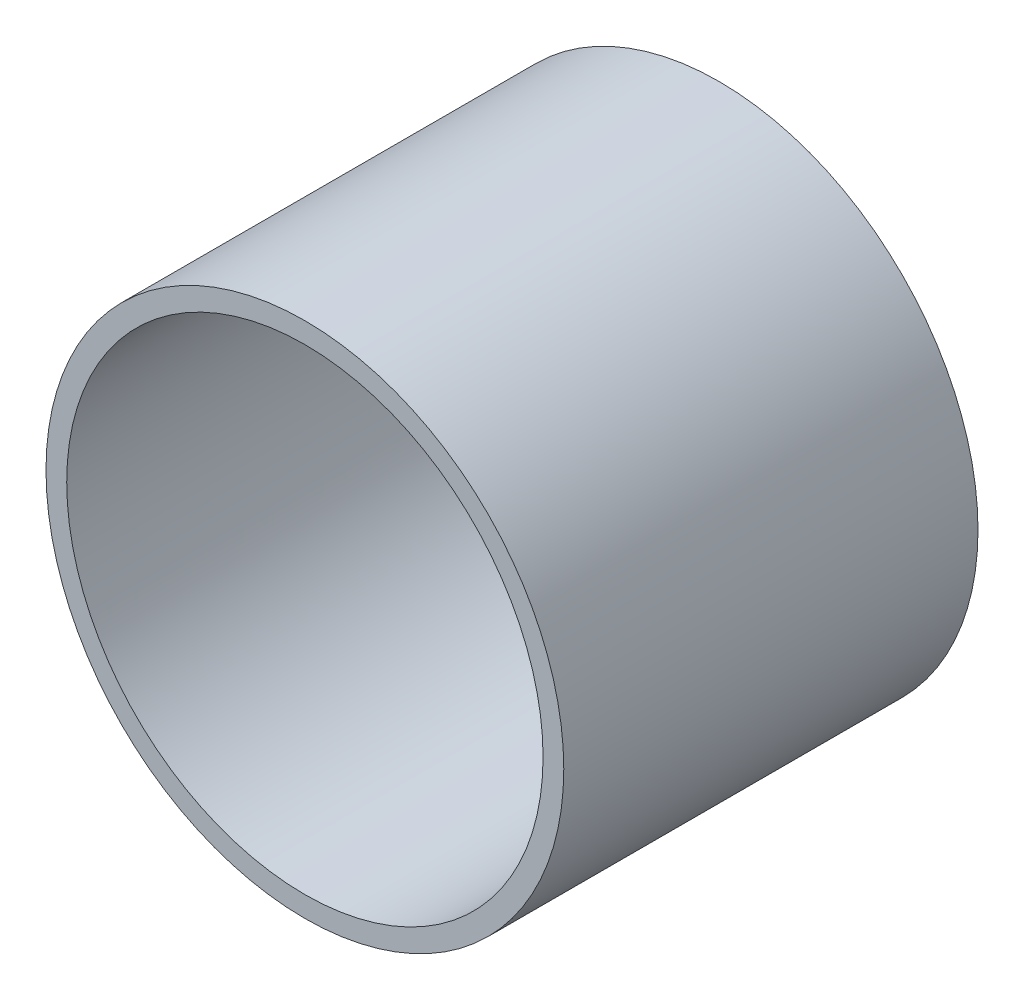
from build123d import *

# Parameters (mm, degrees)
SKETCH1_R      = 3.96875
EXTRUDE1_DEPTH = 6.35
SHELL1_T       = -0.3175


with BuildPart() as part:
    # Sketch1 → Extrude1 (new body)
    with BuildSketch(Plane.XY):
        Circle(SKETCH1_R)
    extrude(amount=EXTRUDE1_DEPTH)

    # Shell1
    shell1_openings = [part.faces().sort_by_distance(p)[0] for p in [
        (0, 0, 6.35),
        (0, 0, 0),
    ]]
    offset(amount=SHELL1_T, openings=shell1_openings, kind=Kind.INTERSECTION)


solid = part.part
